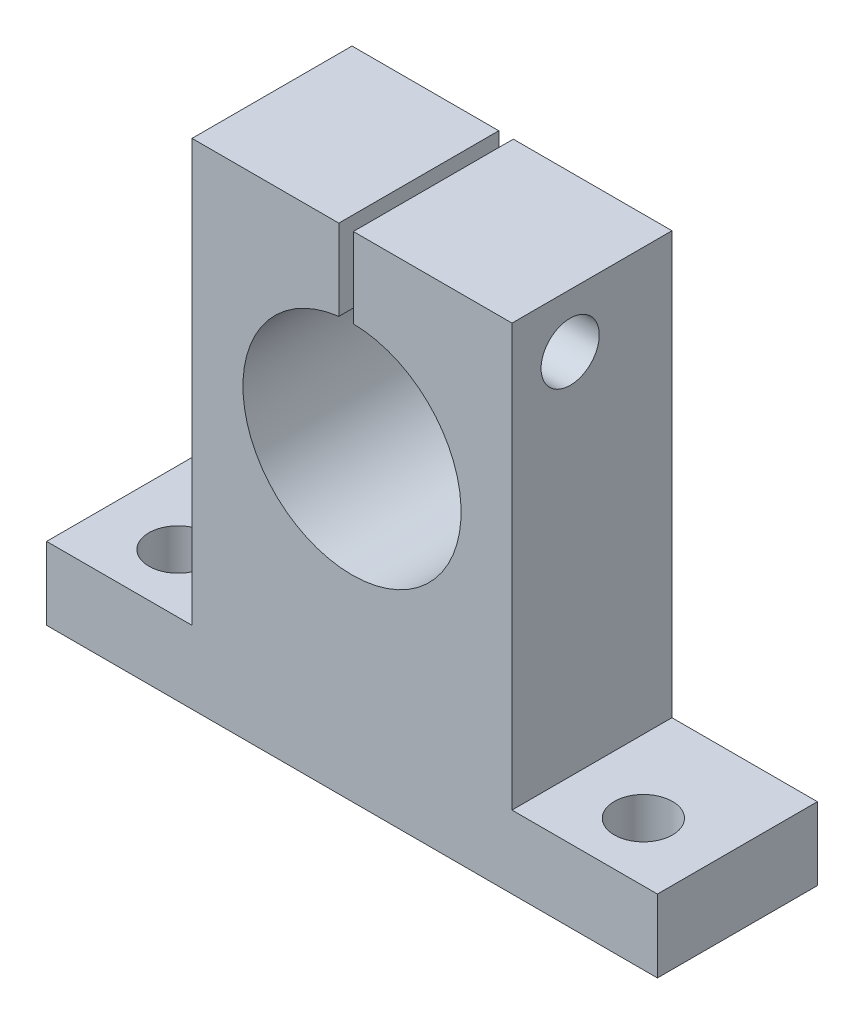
ISO-10303-21;
HEADER;
FILE_DESCRIPTION(('STEP AP214'),'2;1');
FILE_NAME('part.step','',(''),(''),'','','');
FILE_SCHEMA(('AUTOMOTIVE_DESIGN { 1 0 10303 214 1 1 1 1 }'));
ENDSEC;
DATA;
#1=APPLICATION_CONTEXT('core data for automotive mechanical design processes');
#2=APPLICATION_PROTOCOL_DEFINITION('international standard','automotive_design',2000,#1);
#3=PRODUCT_CONTEXT('',#1,'mechanical');
#4=PRODUCT('Part','Part','',(#3));
#5=PRODUCT_RELATED_PRODUCT_CATEGORY('part','',(#4));
#6=PRODUCT_DEFINITION_FORMATION('','',#4);
#7=PRODUCT_DEFINITION_CONTEXT('part definition',#1,'design');
#8=PRODUCT_DEFINITION('design','',#6,#7);
#9=PRODUCT_DEFINITION_SHAPE('','',#8);
#10=(LENGTH_UNIT() NAMED_UNIT(*) SI_UNIT(.MILLI.,.METRE.));
#11=(NAMED_UNIT(*) PLANE_ANGLE_UNIT() SI_UNIT($,.RADIAN.));
#12=(NAMED_UNIT(*) SI_UNIT($,.STERADIAN.) SOLID_ANGLE_UNIT());
#13=UNCERTAINTY_MEASURE_WITH_UNIT(LENGTH_MEASURE(1.E-05),#10,'distance_accuracy_value','');
#14=(GEOMETRIC_REPRESENTATION_CONTEXT(3) GLOBAL_UNCERTAINTY_ASSIGNED_CONTEXT((#13)) GLOBAL_UNIT_ASSIGNED_CONTEXT((#10,
#11,#12)) REPRESENTATION_CONTEXT('',''));
#15=CARTESIAN_POINT('',(0.,0.,0.));
#16=DIRECTION('',(0.,0.,1.));
#17=DIRECTION('',(1.,0.,0.));
#18=AXIS2_PLACEMENT_3D('',#15,#16,#17);
#19=CARTESIAN_POINT('',(0.681248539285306,58.3546814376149,22.));
#20=DIRECTION('',(0.,-1.,0.));
#21=DIRECTION('',(0.,0.,-1.));
#22=AXIS2_PLACEMENT_3D('',#19,#20,#21);
#23=PLANE('',#22);
#24=DIRECTION('',(0.,0.,1.));
#25=VECTOR('',#24,1.);
#26=CARTESIAN_POINT('',(20.8653991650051,58.3546814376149,0.));
#27=LINE('',#26,#25);
#28=CARTESIAN_POINT('',(20.8653991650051,58.3546814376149,0.));
#29=VERTEX_POINT('',#28);
#30=CARTESIAN_POINT('',(20.8653991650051,58.3546814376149,22.));
#31=VERTEX_POINT('',#30);
#32=EDGE_CURVE('E166',#29,#31,#27,.T.);
#33=ORIENTED_EDGE('',*,*,#32,.F.);
#34=DIRECTION('',(-1.,0.,0.));
#35=VECTOR('',#34,1.);
#36=CARTESIAN_POINT('',(0.681248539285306,58.3546814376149,0.));
#37=LINE('',#36,#35);
#38=CARTESIAN_POINT('',(0.681248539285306,58.3546814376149,0.));
#39=VERTEX_POINT('',#38);
#40=EDGE_CURVE('E196',#29,#39,#37,.T.);
#41=ORIENTED_EDGE('',*,*,#40,.T.);
#42=DIRECTION('',(0.,0.,-1.));
#43=VECTOR('',#42,1.);
#44=CARTESIAN_POINT('',(0.681248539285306,58.3546814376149,22.));
#45=LINE('',#44,#43);
#46=CARTESIAN_POINT('',(0.681248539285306,58.3546814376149,22.));
#47=VERTEX_POINT('',#46);
#48=EDGE_CURVE('E218',#47,#39,#45,.T.);
#49=ORIENTED_EDGE('',*,*,#48,.F.);
#50=DIRECTION('',(-1.,0.,0.));
#51=VECTOR('',#50,1.);
#52=CARTESIAN_POINT('',(0.681248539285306,58.3546814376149,22.));
#53=LINE('',#52,#51);
#54=EDGE_CURVE('E177',#31,#47,#53,.T.);
#55=ORIENTED_EDGE('',*,*,#54,.F.);
#56=EDGE_LOOP('',(#33,#41,#49,#55));
#57=FACE_BOUND('',#56,.T.);
#58=ADVANCED_FACE('F32',(#57),#23,.F.);
#59=CARTESIAN_POINT('',(0.,0.,22.));
#60=DIRECTION('',(0.,0.,-1.));
#61=DIRECTION('',(-1.,0.,0.));
#62=AXIS2_PLACEMENT_3D('',#59,#60,#61);
#63=PLANE('',#62);
#64=DIRECTION('',(0.,1.,0.));
#65=VECTOR('',#64,1.);
#66=CARTESIAN_POINT('',(20.8653991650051,58.1616180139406,22.));
#67=LINE('',#66,#65);
#68=CARTESIAN_POINT('',(20.8653991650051,47.2443654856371,22.));
#69=VERTEX_POINT('',#68);
#70=EDGE_CURVE('E299',#69,#31,#67,.T.);
#71=ORIENTED_EDGE('',*,*,#70,.T.);
#72=ORIENTED_EDGE('',*,*,#54,.T.);
#73=DIRECTION('',(0.,-1.,0.));
#74=VECTOR('',#73,1.);
#75=CARTESIAN_POINT('',(0.681248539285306,0.354681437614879,22.));
#76=LINE('',#75,#74);
#77=CARTESIAN_POINT('',(0.681248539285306,0.354681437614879,22.));
#78=VERTEX_POINT('',#77);
#79=EDGE_CURVE('E181',#47,#78,#76,.T.);
#80=ORIENTED_EDGE('',*,*,#79,.T.);
#81=DIRECTION('',(-1.,0.,0.));
#82=VECTOR('',#81,1.);
#83=CARTESIAN_POINT('',(-19.3187514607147,0.354681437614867,22.));
#84=LINE('',#83,#82);
#85=CARTESIAN_POINT('',(-19.3187514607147,0.354681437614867,22.));
#86=VERTEX_POINT('',#85);
#87=EDGE_CURVE('E183',#78,#86,#84,.T.);
#88=ORIENTED_EDGE('',*,*,#87,.T.);
#89=DIRECTION('',(0.,-1.,0.));
#90=VECTOR('',#89,1.);
#91=CARTESIAN_POINT('',(-19.3187514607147,-9.64531856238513,22.));
#92=LINE('',#91,#90);
#93=CARTESIAN_POINT('',(-19.3187514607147,-9.64531856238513,22.));
#94=VERTEX_POINT('',#93);
#95=EDGE_CURVE('E185',#86,#94,#92,.T.);
#96=ORIENTED_EDGE('',*,*,#95,.T.);
#97=DIRECTION('',(1.,0.,0.));
#98=VECTOR('',#97,1.);
#99=CARTESIAN_POINT('',(-19.3187514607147,-9.64531856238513,22.));
#100=LINE('',#99,#98);
#101=CARTESIAN_POINT('',(64.6812485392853,-9.64531856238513,22.));
#102=VERTEX_POINT('',#101);
#103=EDGE_CURVE('E187',#94,#102,#100,.T.);
#104=ORIENTED_EDGE('',*,*,#103,.T.);
#105=DIRECTION('',(0.,1.,0.));
#106=VECTOR('',#105,1.);
#107=CARTESIAN_POINT('',(64.6812485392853,-9.64531856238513,22.));
#108=LINE('',#107,#106);
#109=CARTESIAN_POINT('',(64.6812485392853,0.354681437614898,22.));
#110=VERTEX_POINT('',#109);
#111=EDGE_CURVE('E169',#102,#110,#108,.T.);
#112=ORIENTED_EDGE('',*,*,#111,.T.);
#113=DIRECTION('',(-1.,0.,0.));
#114=VECTOR('',#113,1.);
#115=CARTESIAN_POINT('',(44.6812485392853,0.354681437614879,22.));
#116=LINE('',#115,#114);
#117=CARTESIAN_POINT('',(44.6812485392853,0.354681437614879,22.));
#118=VERTEX_POINT('',#117);
#119=EDGE_CURVE('E172',#110,#118,#116,.T.);
#120=ORIENTED_EDGE('',*,*,#119,.T.);
#121=DIRECTION('',(0.,1.,0.));
#122=VECTOR('',#121,1.);
#123=CARTESIAN_POINT('',(44.6812485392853,0.354681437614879,22.));
#124=LINE('',#123,#122);
#125=CARTESIAN_POINT('',(44.6812485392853,58.3546814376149,22.));
#126=VERTEX_POINT('',#125);
#127=EDGE_CURVE('E175',#118,#126,#124,.T.);
#128=ORIENTED_EDGE('',*,*,#127,.T.);
#129=CARTESIAN_POINT('',(22.8653991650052,58.3546814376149,22.));
#130=VERTEX_POINT('',#129);
#131=EDGE_CURVE('E178',#126,#130,#53,.T.);
#132=ORIENTED_EDGE('',*,*,#131,.T.);
#133=DIRECTION('',(0.,1.,0.));
#134=VECTOR('',#133,1.);
#135=CARTESIAN_POINT('',(22.8653991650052,47.3535510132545,22.));
#136=LINE('',#135,#134);
#137=CARTESIAN_POINT('',(22.8653991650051,47.3535510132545,22.));
#138=VERTEX_POINT('',#137);
#139=EDGE_CURVE('E301',#138,#130,#136,.T.);
#140=ORIENTED_EDGE('',*,*,#139,.F.);
#141=CARTESIAN_POINT('',(22.6812485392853,32.3546814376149,22.));
#142=DIRECTION('',(0.,0.,1.));
#143=DIRECTION('',(1.,0.,0.));
#144=AXIS2_PLACEMENT_3D('',#141,#142,#143);
#145=CIRCLE('',#144,15.);
#146=EDGE_CURVE('E159',#69,#138,#145,.T.);
#147=ORIENTED_EDGE('',*,*,#146,.F.);
#148=EDGE_LOOP('',(#71,#72,#80,#88,#96,#104,#112,#120,#128,#132,#140,#147));
#149=FACE_BOUND('',#148,.T.);
#150=ADVANCED_FACE('F258',(#149),#63,.F.);
#151=CARTESIAN_POINT('',(0.,0.,0.));
#152=DIRECTION('',(0.,0.,-1.));
#153=DIRECTION('',(-1.,0.,0.));
#154=AXIS2_PLACEMENT_3D('',#151,#152,#153);
#155=PLANE('',#154);
#156=ORIENTED_EDGE('',*,*,#40,.F.);
#157=DIRECTION('',(0.,1.,0.));
#158=VECTOR('',#157,1.);
#159=CARTESIAN_POINT('',(20.8653991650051,47.2443654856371,0.));
#160=LINE('',#159,#158);
#161=CARTESIAN_POINT('',(20.8653991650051,47.2443654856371,0.));
#162=VERTEX_POINT('',#161);
#163=EDGE_CURVE('E293',#162,#29,#160,.T.);
#164=ORIENTED_EDGE('',*,*,#163,.F.);
#165=CARTESIAN_POINT('',(22.6812485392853,32.3546814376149,0.));
#166=DIRECTION('',(0.,0.,1.));
#167=DIRECTION('',(1.,0.,0.));
#168=AXIS2_PLACEMENT_3D('',#165,#166,#167);
#169=CIRCLE('',#168,15.);
#170=CARTESIAN_POINT('',(22.8653991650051,47.3535510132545,0.));
#171=VERTEX_POINT('',#170);
#172=EDGE_CURVE('E152',#162,#171,#169,.T.);
#173=ORIENTED_EDGE('',*,*,#172,.T.);
#174=DIRECTION('',(0.,-1.,0.));
#175=VECTOR('',#174,1.);
#176=CARTESIAN_POINT('',(22.8653991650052,58.3546814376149,0.));
#177=LINE('',#176,#175);
#178=CARTESIAN_POINT('',(22.8653991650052,58.3546814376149,0.));
#179=VERTEX_POINT('',#178);
#180=EDGE_CURVE('E291',#179,#171,#177,.T.);
#181=ORIENTED_EDGE('',*,*,#180,.F.);
#182=CARTESIAN_POINT('',(44.6812485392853,58.3546814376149,0.));
#183=VERTEX_POINT('',#182);
#184=EDGE_CURVE('E197',#183,#179,#37,.T.);
#185=ORIENTED_EDGE('',*,*,#184,.F.);
#186=DIRECTION('',(0.,1.,0.));
#187=VECTOR('',#186,1.);
#188=CARTESIAN_POINT('',(44.6812485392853,0.354681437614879,0.));
#189=LINE('',#188,#187);
#190=CARTESIAN_POINT('',(44.6812485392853,0.354681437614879,0.));
#191=VERTEX_POINT('',#190);
#192=EDGE_CURVE('E194',#191,#183,#189,.T.);
#193=ORIENTED_EDGE('',*,*,#192,.F.);
#194=DIRECTION('',(-1.,0.,0.));
#195=VECTOR('',#194,1.);
#196=CARTESIAN_POINT('',(44.6812485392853,0.354681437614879,0.));
#197=LINE('',#196,#195);
#198=CARTESIAN_POINT('',(64.6812485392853,0.354681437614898,0.));
#199=VERTEX_POINT('',#198);
#200=EDGE_CURVE('E192',#199,#191,#197,.T.);
#201=ORIENTED_EDGE('',*,*,#200,.F.);
#202=DIRECTION('',(0.,1.,0.));
#203=VECTOR('',#202,1.);
#204=CARTESIAN_POINT('',(64.6812485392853,-9.64531856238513,0.));
#205=LINE('',#204,#203);
#206=CARTESIAN_POINT('',(64.6812485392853,-9.64531856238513,0.));
#207=VERTEX_POINT('',#206);
#208=EDGE_CURVE('E168',#207,#199,#205,.T.);
#209=ORIENTED_EDGE('',*,*,#208,.F.);
#210=DIRECTION('',(1.,0.,0.));
#211=VECTOR('',#210,1.);
#212=CARTESIAN_POINT('',(-19.3187514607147,-9.64531856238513,0.));
#213=LINE('',#212,#211);
#214=CARTESIAN_POINT('',(-19.3187514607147,-9.64531856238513,0.));
#215=VERTEX_POINT('',#214);
#216=EDGE_CURVE('E173',#215,#207,#213,.T.);
#217=ORIENTED_EDGE('',*,*,#216,.F.);
#218=DIRECTION('',(0.,-1.,0.));
#219=VECTOR('',#218,1.);
#220=CARTESIAN_POINT('',(-19.3187514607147,-9.64531856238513,0.));
#221=LINE('',#220,#219);
#222=CARTESIAN_POINT('',(-19.3187514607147,0.354681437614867,0.));
#223=VERTEX_POINT('',#222);
#224=EDGE_CURVE('E204',#223,#215,#221,.T.);
#225=ORIENTED_EDGE('',*,*,#224,.F.);
#226=DIRECTION('',(-1.,0.,0.));
#227=VECTOR('',#226,1.);
#228=CARTESIAN_POINT('',(-19.3187514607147,0.354681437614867,0.));
#229=LINE('',#228,#227);
#230=CARTESIAN_POINT('',(0.681248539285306,0.354681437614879,0.));
#231=VERTEX_POINT('',#230);
#232=EDGE_CURVE('E202',#231,#223,#229,.T.);
#233=ORIENTED_EDGE('',*,*,#232,.F.);
#234=DIRECTION('',(0.,-1.,0.));
#235=VECTOR('',#234,1.);
#236=CARTESIAN_POINT('',(0.681248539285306,0.354681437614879,0.));
#237=LINE('',#236,#235);
#238=EDGE_CURVE('E200',#39,#231,#237,.T.);
#239=ORIENTED_EDGE('',*,*,#238,.F.);
#240=EDGE_LOOP('',(#156,#164,#173,#181,#185,#193,#201,#209,#217,#225,#233,#239));
#241=FACE_BOUND('',#240,.T.);
#242=ADVANCED_FACE('F265',(#241),#155,.T.);
#243=CARTESIAN_POINT('',(64.6812485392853,-9.64531856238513,22.));
#244=DIRECTION('',(-1.,0.,0.));
#245=DIRECTION('',(0.,0.,1.));
#246=AXIS2_PLACEMENT_3D('',#243,#244,#245);
#247=PLANE('',#246);
#248=ORIENTED_EDGE('',*,*,#208,.T.);
#249=DIRECTION('',(0.,0.,-1.));
#250=VECTOR('',#249,1.);
#251=CARTESIAN_POINT('',(64.6812485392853,0.354681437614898,22.));
#252=LINE('',#251,#250);
#253=EDGE_CURVE('E140',#110,#199,#252,.T.);
#254=ORIENTED_EDGE('',*,*,#253,.F.);
#255=ORIENTED_EDGE('',*,*,#111,.F.);
#256=DIRECTION('',(0.,0.,-1.));
#257=VECTOR('',#256,1.);
#258=CARTESIAN_POINT('',(64.6812485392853,-9.64531856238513,22.));
#259=LINE('',#258,#257);
#260=EDGE_CURVE('E189',#102,#207,#259,.T.);
#261=ORIENTED_EDGE('',*,*,#260,.T.);
#262=EDGE_LOOP('',(#248,#254,#255,#261));
#263=FACE_BOUND('',#262,.T.);
#264=ADVANCED_FACE('F34',(#263),#247,.F.);
#265=CARTESIAN_POINT('',(44.6812485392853,0.354681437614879,22.));
#266=DIRECTION('',(0.,-1.,0.));
#267=DIRECTION('',(1.,0.,0.));
#268=AXIS2_PLACEMENT_3D('',#265,#266,#267);
#269=PLANE('',#268);
#270=CARTESIAN_POINT('',(54.6812485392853,0.354681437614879,13.9325883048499));
#271=DIRECTION('',(0.,1.,0.));
#272=DIRECTION('',(0.,0.,1.));
#273=AXIS2_PLACEMENT_3D('',#270,#271,#272);
#274=CIRCLE('',#273,4.);
#275=CARTESIAN_POINT('',(54.6812485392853,0.354681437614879,17.9325883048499));
#276=VERTEX_POINT('',#275);
#277=EDGE_CURVE('E231',#276,#276,#274,.T.);
#278=ORIENTED_EDGE('',*,*,#277,.F.);
#279=EDGE_LOOP('',(#278));
#280=FACE_BOUND('',#279,.T.);
#281=ORIENTED_EDGE('',*,*,#200,.T.);
#282=DIRECTION('',(0.,0.,-1.));
#283=VECTOR('',#282,1.);
#284=CARTESIAN_POINT('',(44.6812485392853,0.354681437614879,22.));
#285=LINE('',#284,#283);
#286=EDGE_CURVE('E224',#118,#191,#285,.T.);
#287=ORIENTED_EDGE('',*,*,#286,.F.);
#288=ORIENTED_EDGE('',*,*,#119,.F.);
#289=ORIENTED_EDGE('',*,*,#253,.T.);
#290=EDGE_LOOP('',(#281,#287,#288,#289));
#291=FACE_BOUND('',#290,.T.);
#292=ADVANCED_FACE('F281',(#280,#291),#269,.F.);
#293=CARTESIAN_POINT('',(44.6812485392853,0.354681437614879,22.));
#294=DIRECTION('',(-1.,0.,0.));
#295=DIRECTION('',(0.,0.,1.));
#296=AXIS2_PLACEMENT_3D('',#293,#294,#295);
#297=PLANE('',#296);
#298=CARTESIAN_POINT('',(44.6812485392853,50.9384829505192,14.));
#299=DIRECTION('',(-1.,0.,0.));
#300=DIRECTION('',(0.,0.,1.));
#301=AXIS2_PLACEMENT_3D('',#298,#299,#300);
#302=CIRCLE('',#301,3.99999999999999);
#303=CARTESIAN_POINT('',(44.6812485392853,50.9384829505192,18.));
#304=VERTEX_POINT('',#303);
#305=EDGE_CURVE('E356',#304,#304,#302,.T.);
#306=ORIENTED_EDGE('',*,*,#305,.T.);
#307=EDGE_LOOP('',(#306));
#308=FACE_BOUND('',#307,.T.);
#309=ORIENTED_EDGE('',*,*,#192,.T.);
#310=DIRECTION('',(0.,0.,-1.));
#311=VECTOR('',#310,1.);
#312=CARTESIAN_POINT('',(44.6812485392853,58.3546814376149,22.));
#313=LINE('',#312,#311);
#314=EDGE_CURVE('E221',#126,#183,#313,.T.);
#315=ORIENTED_EDGE('',*,*,#314,.F.);
#316=ORIENTED_EDGE('',*,*,#127,.F.);
#317=ORIENTED_EDGE('',*,*,#286,.T.);
#318=EDGE_LOOP('',(#309,#315,#316,#317));
#319=FACE_BOUND('',#318,.T.);
#320=ADVANCED_FACE('F273',(#308,#319),#297,.F.);
#321=ORIENTED_EDGE('',*,*,#184,.T.);
#322=DIRECTION('',(0.,0.,1.));
#323=VECTOR('',#322,1.);
#324=CARTESIAN_POINT('',(22.8653991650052,58.3546814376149,0.));
#325=LINE('',#324,#323);
#326=EDGE_CURVE('E163',#179,#130,#325,.T.);
#327=ORIENTED_EDGE('',*,*,#326,.T.);
#328=ORIENTED_EDGE('',*,*,#131,.F.);
#329=ORIENTED_EDGE('',*,*,#314,.T.);
#330=EDGE_LOOP('',(#321,#327,#328,#329));
#331=FACE_BOUND('',#330,.T.);
#332=ADVANCED_FACE('F261',(#331),#23,.F.);
#333=CARTESIAN_POINT('',(0.681248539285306,0.354681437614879,22.));
#334=DIRECTION('',(1.,0.,0.));
#335=DIRECTION('',(0.,0.,-1.));
#336=AXIS2_PLACEMENT_3D('',#333,#334,#335);
#337=PLANE('',#336);
#338=CARTESIAN_POINT('',(0.681248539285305,50.9384829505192,14.));
#339=DIRECTION('',(-1.,0.,0.));
#340=DIRECTION('',(0.,0.,1.));
#341=AXIS2_PLACEMENT_3D('',#338,#339,#340);
#342=CIRCLE('',#341,3.99999999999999);
#343=CARTESIAN_POINT('',(0.681248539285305,50.9384829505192,18.));
#344=VERTEX_POINT('',#343);
#345=EDGE_CURVE('E147',#344,#344,#342,.T.);
#346=ORIENTED_EDGE('',*,*,#345,.F.);
#347=EDGE_LOOP('',(#346));
#348=FACE_BOUND('',#347,.T.);
#349=ORIENTED_EDGE('',*,*,#238,.T.);
#350=DIRECTION('',(0.,0.,-1.));
#351=VECTOR('',#350,1.);
#352=CARTESIAN_POINT('',(0.681248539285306,0.354681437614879,22.));
#353=LINE('',#352,#351);
#354=EDGE_CURVE('E215',#78,#231,#353,.T.);
#355=ORIENTED_EDGE('',*,*,#354,.F.);
#356=ORIENTED_EDGE('',*,*,#79,.F.);
#357=ORIENTED_EDGE('',*,*,#48,.T.);
#358=EDGE_LOOP('',(#349,#355,#356,#357));
#359=FACE_BOUND('',#358,.T.);
#360=ADVANCED_FACE('F272',(#348,#359),#337,.F.);
#361=CARTESIAN_POINT('',(-19.3187514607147,0.354681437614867,22.));
#362=DIRECTION('',(0.,-1.,0.));
#363=DIRECTION('',(1.,0.,0.));
#364=AXIS2_PLACEMENT_3D('',#361,#362,#363);
#365=PLANE('',#364);
#366=CARTESIAN_POINT('',(-9.31875146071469,0.354681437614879,13.9325883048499));
#367=DIRECTION('',(0.,1.,0.));
#368=DIRECTION('',(0.,0.,1.));
#369=AXIS2_PLACEMENT_3D('',#366,#367,#368);
#370=CIRCLE('',#369,4.);
#371=CARTESIAN_POINT('',(-9.31875146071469,0.354681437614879,17.9325883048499));
#372=VERTEX_POINT('',#371);
#373=EDGE_CURVE('E232',#372,#372,#370,.T.);
#374=ORIENTED_EDGE('',*,*,#373,.F.);
#375=EDGE_LOOP('',(#374));
#376=FACE_BOUND('',#375,.T.);
#377=ORIENTED_EDGE('',*,*,#232,.T.);
#378=DIRECTION('',(0.,0.,-1.));
#379=VECTOR('',#378,1.);
#380=CARTESIAN_POINT('',(-19.3187514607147,0.354681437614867,22.));
#381=LINE('',#380,#379);
#382=EDGE_CURVE('E212',#86,#223,#381,.T.);
#383=ORIENTED_EDGE('',*,*,#382,.F.);
#384=ORIENTED_EDGE('',*,*,#87,.F.);
#385=ORIENTED_EDGE('',*,*,#354,.T.);
#386=EDGE_LOOP('',(#377,#383,#384,#385));
#387=FACE_BOUND('',#386,.T.);
#388=ADVANCED_FACE('F279',(#376,#387),#365,.F.);
#389=CARTESIAN_POINT('',(-19.3187514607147,-9.64531856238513,22.));
#390=DIRECTION('',(1.,0.,0.));
#391=DIRECTION('',(0.,1.,0.));
#392=AXIS2_PLACEMENT_3D('',#389,#390,#391);
#393=PLANE('',#392);
#394=ORIENTED_EDGE('',*,*,#224,.T.);
#395=DIRECTION('',(0.,0.,-1.));
#396=VECTOR('',#395,1.);
#397=CARTESIAN_POINT('',(-19.3187514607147,-9.64531856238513,22.));
#398=LINE('',#397,#396);
#399=EDGE_CURVE('E209',#94,#215,#398,.T.);
#400=ORIENTED_EDGE('',*,*,#399,.F.);
#401=ORIENTED_EDGE('',*,*,#95,.F.);
#402=ORIENTED_EDGE('',*,*,#382,.T.);
#403=EDGE_LOOP('',(#394,#400,#401,#402));
#404=FACE_BOUND('',#403,.T.);
#405=ADVANCED_FACE('F323',(#404),#393,.F.);
#406=CARTESIAN_POINT('',(-19.3187514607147,-9.64531856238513,22.));
#407=DIRECTION('',(0.,1.,0.));
#408=DIRECTION('',(0.,0.,1.));
#409=AXIS2_PLACEMENT_3D('',#406,#407,#408);
#410=PLANE('',#409);
#411=CARTESIAN_POINT('',(-9.31875146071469,-9.64531856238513,13.9325883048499));
#412=DIRECTION('',(0.,1.,0.));
#413=DIRECTION('',(0.,0.,1.));
#414=AXIS2_PLACEMENT_3D('',#411,#412,#413);
#415=CIRCLE('',#414,4.);
#416=CARTESIAN_POINT('',(-9.31875146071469,-9.64531856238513,17.9325883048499));
#417=VERTEX_POINT('',#416);
#418=EDGE_CURVE('E229',#417,#417,#415,.T.);
#419=ORIENTED_EDGE('',*,*,#418,.T.);
#420=EDGE_LOOP('',(#419));
#421=FACE_BOUND('',#420,.T.);
#422=CARTESIAN_POINT('',(54.6812485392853,-9.64531856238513,13.9325883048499));
#423=DIRECTION('',(0.,1.,0.));
#424=DIRECTION('',(0.,0.,1.));
#425=AXIS2_PLACEMENT_3D('',#422,#423,#424);
#426=CIRCLE('',#425,4.);
#427=CARTESIAN_POINT('',(54.6812485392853,-9.64531856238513,17.9325883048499));
#428=VERTEX_POINT('',#427);
#429=EDGE_CURVE('E302',#428,#428,#426,.T.);
#430=ORIENTED_EDGE('',*,*,#429,.T.);
#431=EDGE_LOOP('',(#430));
#432=FACE_BOUND('',#431,.T.);
#433=ORIENTED_EDGE('',*,*,#216,.T.);
#434=ORIENTED_EDGE('',*,*,#260,.F.);
#435=ORIENTED_EDGE('',*,*,#103,.F.);
#436=ORIENTED_EDGE('',*,*,#399,.T.);
#437=EDGE_LOOP('',(#433,#434,#435,#436));
#438=FACE_BOUND('',#437,.T.);
#439=ADVANCED_FACE('F319',(#421,#432,#438),#410,.F.);
#440=CARTESIAN_POINT('',(20.8653991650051,58.1616180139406,0.));
#441=DIRECTION('',(1.,0.,0.));
#442=DIRECTION('',(0.,0.,-1.));
#443=AXIS2_PLACEMENT_3D('',#440,#441,#442);
#444=PLANE('',#443);
#445=CARTESIAN_POINT('',(20.8653991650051,50.9384829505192,14.));
#446=DIRECTION('',(1.,0.,0.));
#447=DIRECTION('',(0.,0.,-1.));
#448=AXIS2_PLACEMENT_3D('',#445,#446,#447);
#449=CIRCLE('',#448,3.99999999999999);
#450=CARTESIAN_POINT('',(20.8653991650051,47.2443654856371,12.4658891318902));
#451=VERTEX_POINT('',#450);
#452=CARTESIAN_POINT('',(20.8653991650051,47.2443654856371,15.5341108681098));
#453=VERTEX_POINT('',#452);
#454=EDGE_CURVE('E52',#451,#453,#449,.T.);
#455=ORIENTED_EDGE('',*,*,#454,.F.);
#456=DIRECTION('',(0.,0.,1.));
#457=VECTOR('',#456,1.);
#458=CARTESIAN_POINT('',(20.8653991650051,47.2443654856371,0.));
#459=LINE('',#458,#457);
#460=EDGE_CURVE('E143',#162,#451,#459,.T.);
#461=ORIENTED_EDGE('',*,*,#460,.F.);
#462=ORIENTED_EDGE('',*,*,#163,.T.);
#463=ORIENTED_EDGE('',*,*,#32,.T.);
#464=ORIENTED_EDGE('',*,*,#70,.F.);
#465=EDGE_CURVE('E146',#453,#69,#459,.T.);
#466=ORIENTED_EDGE('',*,*,#465,.F.);
#467=EDGE_LOOP('',(#455,#461,#462,#463,#464,#466));
#468=FACE_BOUND('',#467,.T.);
#469=ADVANCED_FACE('F142',(#468),#444,.T.);
#470=CARTESIAN_POINT('',(22.8653991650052,47.3535510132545,0.));
#471=DIRECTION('',(1.,0.,0.));
#472=DIRECTION('',(0.,0.,-1.));
#473=AXIS2_PLACEMENT_3D('',#470,#471,#472);
#474=PLANE('',#473);
#475=DIRECTION('',(0.,0.,1.));
#476=VECTOR('',#475,1.);
#477=CARTESIAN_POINT('',(22.8653991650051,47.3535510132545,0.));
#478=LINE('',#477,#476);
#479=CARTESIAN_POINT('',(22.8653991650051,47.3535510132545,12.2256654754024));
#480=VERTEX_POINT('',#479);
#481=EDGE_CURVE('E156',#171,#480,#478,.T.);
#482=ORIENTED_EDGE('',*,*,#481,.T.);
#483=CARTESIAN_POINT('',(22.8653991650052,50.9384829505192,14.));
#484=DIRECTION('',(1.,0.,0.));
#485=DIRECTION('',(0.,0.,-1.));
#486=AXIS2_PLACEMENT_3D('',#483,#484,#485);
#487=CIRCLE('',#486,3.99999999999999);
#488=CARTESIAN_POINT('',(22.8653991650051,47.3535510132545,15.7743345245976));
#489=VERTEX_POINT('',#488);
#490=EDGE_CURVE('E59',#480,#489,#487,.T.);
#491=ORIENTED_EDGE('',*,*,#490,.T.);
#492=EDGE_CURVE('E154',#489,#138,#478,.T.);
#493=ORIENTED_EDGE('',*,*,#492,.T.);
#494=ORIENTED_EDGE('',*,*,#139,.T.);
#495=ORIENTED_EDGE('',*,*,#326,.F.);
#496=ORIENTED_EDGE('',*,*,#180,.T.);
#497=EDGE_LOOP('',(#482,#491,#493,#494,#495,#496));
#498=FACE_BOUND('',#497,.T.);
#499=ADVANCED_FACE('F254',(#498),#474,.F.);
#500=CARTESIAN_POINT('',(22.6812485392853,32.3546814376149,0.));
#501=DIRECTION('',(0.,0.,1.));
#502=DIRECTION('',(1.,0.,0.));
#503=AXIS2_PLACEMENT_3D('',#500,#501,#502);
#504=CYLINDRICAL_SURFACE('',#503,15.);
#505=ORIENTED_EDGE('',*,*,#492,.F.);
#506=CARTESIAN_POINT('',(22.8653991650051,47.3535510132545,15.7743345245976));
#507=CARTESIAN_POINT('',(22.9485249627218,47.3525308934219,15.7722670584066));
#508=CARTESIAN_POINT('',(23.0315996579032,47.35081906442,15.7688114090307));
#509=CARTESIAN_POINT('',(23.1975548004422,47.346022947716,15.7590521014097));
#510=CARTESIAN_POINT('',(23.2804352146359,47.3429384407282,15.7527479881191));
#511=CARTESIAN_POINT('',(23.5293537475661,47.3316091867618,15.7293870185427));
#512=CARTESIAN_POINT('',(23.6949168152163,47.3212980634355,15.7078987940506));
#513=CARTESIAN_POINT('',(24.0295819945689,47.2949367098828,15.6509380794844));
#514=CARTESIAN_POINT('',(24.1985849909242,47.2786863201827,15.6149727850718));
#515=CARTESIAN_POINT('',(24.5315369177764,47.2410623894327,15.5268984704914));
#516=CARTESIAN_POINT('',(24.6954963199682,47.2197004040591,15.4748257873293));
#517=CARTESIAN_POINT('',(24.9277628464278,47.1856821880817,15.3846884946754));
#518=CARTESIAN_POINT('',(24.9993965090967,47.1746445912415,15.3545098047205));
#519=CARTESIAN_POINT('',(25.1404748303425,47.1518872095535,15.2895297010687));
#520=CARTESIAN_POINT('',(25.2099188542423,47.1401672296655,15.2547269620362));
#521=CARTESIAN_POINT('',(25.3453198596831,47.1163686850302,15.1802364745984));
#522=CARTESIAN_POINT('',(25.4113012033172,47.1042939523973,15.140592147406));
#523=CARTESIAN_POINT('',(25.5393722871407,47.080012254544,15.0555378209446));
#524=CARTESIAN_POINT('',(25.6014654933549,47.0678054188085,15.0101330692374));
#525=CARTESIAN_POINT('',(25.7193377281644,47.0439143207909,14.9136529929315));
#526=CARTESIAN_POINT('',(25.7752108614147,47.0322245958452,14.8626954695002));
#527=CARTESIAN_POINT('',(25.8799871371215,47.0097466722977,14.7537386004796));
#528=CARTESIAN_POINT('',(25.9288903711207,46.9989584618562,14.695739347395));
#529=CARTESIAN_POINT('',(26.0103762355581,46.9806306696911,14.5815734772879));
#530=CARTESIAN_POINT('',(26.0443047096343,46.9728465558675,14.5264194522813));
#531=CARTESIAN_POINT('',(26.1028778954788,46.9592479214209,14.411140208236));
#532=CARTESIAN_POINT('',(26.1275369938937,46.9534303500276,14.3510228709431));
#533=CARTESIAN_POINT('',(26.162159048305,46.945210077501,14.2375630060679));
#534=CARTESIAN_POINT('',(26.1739040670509,46.9423958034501,14.1847983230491));
#535=CARTESIAN_POINT('',(26.1885266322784,46.9388872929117,14.0779877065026));
#536=CARTESIAN_POINT('',(26.1914099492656,46.9381916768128,14.0239426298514));
#537=CARTESIAN_POINT('',(26.188055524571,46.9389985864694,13.9161428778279));
#538=CARTESIAN_POINT('',(26.1818150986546,46.9405017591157,13.8623882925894));
#539=CARTESIAN_POINT('',(26.1607612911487,46.9455383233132,13.7566857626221));
#540=CARTESIAN_POINT('',(26.145941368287,46.949073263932,13.7047392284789));
#541=CARTESIAN_POINT('',(26.1038370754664,46.9590118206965,13.5901905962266));
#542=CARTESIAN_POINT('',(26.0742734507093,46.9659310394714,13.5284760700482));
#543=CARTESIAN_POINT('',(26.0057718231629,46.9816695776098,13.4107853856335));
#544=CARTESIAN_POINT('',(25.9668169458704,46.9904923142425,13.3548198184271));
#545=CARTESIAN_POINT('',(25.8603305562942,47.0140707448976,13.2217909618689));
#546=CARTESIAN_POINT('',(25.7883372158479,47.0295629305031,13.1484600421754));
#547=CARTESIAN_POINT('',(25.634182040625,47.0613610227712,13.0137285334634));
#548=CARTESIAN_POINT('',(25.5519977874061,47.0776686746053,12.952355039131));
#549=CARTESIAN_POINT('',(25.3910931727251,47.1080758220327,12.8464712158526));
#550=CARTESIAN_POINT('',(25.3131126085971,47.1222083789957,12.8008249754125));
#551=CARTESIAN_POINT('',(25.1533859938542,47.149785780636,12.7163530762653));
#552=CARTESIAN_POINT('',(25.0716370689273,47.163230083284,12.6775327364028));
#553=CARTESIAN_POINT('',(24.9050740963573,47.189159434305,12.605713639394));
#554=CARTESIAN_POINT('',(24.8202483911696,47.2016401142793,12.5727406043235));
#555=CARTESIAN_POINT('',(24.6485410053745,47.2253667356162,12.5121075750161));
#556=CARTESIAN_POINT('',(24.561658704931,47.2366122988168,12.4844492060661));
#557=CARTESIAN_POINT('',(24.3428361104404,47.2629529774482,12.4213376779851));
#558=CARTESIAN_POINT('',(24.2099394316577,47.2771876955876,12.3888312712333));
#559=CARTESIAN_POINT('',(23.9418378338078,47.302225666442,12.3331011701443));
#560=CARTESIAN_POINT('',(23.8066313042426,47.3130264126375,12.3098842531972));
#561=CARTESIAN_POINT('',(23.5373480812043,47.3308271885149,12.2722090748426));
#562=CARTESIAN_POINT('',(23.4032972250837,47.3378942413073,12.2575957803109));
#563=CARTESIAN_POINT('',(23.1346578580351,47.3484314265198,12.2360252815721));
#564=CARTESIAN_POINT('',(23.0000705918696,47.3519074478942,12.2290555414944));
#565=CARTESIAN_POINT('',(22.8653991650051,47.3535510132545,12.2256654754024));
#566=B_SPLINE_CURVE_WITH_KNOTS('',3,(#506,#507,#508,#509,#510,#511,#512,#513,#514,#515,#516,
#517,#518,#519,#520,#521,#522,#523,#524,#525,#526,#527,#528,#529,#530,#531,#532,#533,#534,#535,
#536,#537,#538,#539,#540,#541,#542,#543,#544,#545,#546,#547,#548,#549,#550,#551,#552,#553,#554,
#555,#556,#557,#558,#559,#560,#561,#562,#563,#564,#565),.UNSPECIFIED.,.F.,.F.,(4,2,2,2,2,2,2,2,
2,2,2,2,2,2,2,2,2,2,2,2,2,2,2,2,2,2,2,2,2,4),(0.,0.249441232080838,0.498922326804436,
1.00013637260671,1.52008973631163,2.03887857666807,2.27428009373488,2.50974922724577,
2.74324337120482,2.97652631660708,3.20557763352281,3.43462594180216,3.62957551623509,
3.82422125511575,3.98588901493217,4.14745147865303,4.30906148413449,4.47079486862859,
4.67598787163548,4.88155235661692,5.19158562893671,5.5023134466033,5.77629351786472,
6.05048614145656,6.32585652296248,6.60131098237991,7.01351091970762,7.42601104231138,
7.83083060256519,8.2349852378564),.UNSPECIFIED.);
#567=EDGE_CURVE('E11',#489,#480,#566,.T.);
#568=ORIENTED_EDGE('',*,*,#567,.T.);
#569=ORIENTED_EDGE('',*,*,#481,.F.);
#570=ORIENTED_EDGE('',*,*,#172,.F.);
#571=ORIENTED_EDGE('',*,*,#460,.T.);
#572=CARTESIAN_POINT('',(20.8653991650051,47.2443654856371,12.4658891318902));
#573=CARTESIAN_POINT('',(20.805768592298,47.2370938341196,12.4834065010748));
#574=CARTESIAN_POINT('',(20.7465073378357,47.2295023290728,12.502029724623));
#575=CARTESIAN_POINT('',(20.6288403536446,47.2137240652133,12.5417028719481));
#576=CARTESIAN_POINT('',(20.5704352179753,47.2055369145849,12.5627543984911));
#577=CARTESIAN_POINT('',(20.3951075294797,47.1799169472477,12.6304904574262));
#578=CARTESIAN_POINT('',(20.2798248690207,47.1616407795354,12.6812575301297));
#579=CARTESIAN_POINT('',(20.0556257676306,47.1235366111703,12.7958973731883));
#580=CARTESIAN_POINT('',(19.9467333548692,47.103703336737,12.8598159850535));
#581=CARTESIAN_POINT('',(19.7403081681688,47.063921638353,13.0033493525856));
#582=CARTESIAN_POINT('',(19.6427090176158,47.0439746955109,13.0828641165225));
#583=CARTESIAN_POINT('',(19.5065763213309,47.0149644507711,13.2200046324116));
#584=CARTESIAN_POINT('',(19.4614910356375,47.0051072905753,13.2709300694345));
#585=CARTESIAN_POINT('',(19.3785975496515,46.9866425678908,13.3787485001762));
#586=CARTESIAN_POINT('',(19.3407923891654,46.9780355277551,13.4356439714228));
#587=CARTESIAN_POINT('',(19.2745069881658,46.9627372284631,13.5559718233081));
#588=CARTESIAN_POINT('',(19.2461539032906,46.9560722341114,13.6194793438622));
#589=CARTESIAN_POINT('',(19.2023522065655,46.9456993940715,13.7510157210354));
#590=CARTESIAN_POINT('',(19.1868745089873,46.9419848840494,13.8190340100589));
#591=CARTESIAN_POINT('',(19.1719015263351,46.9383891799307,13.9472807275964));
#592=CARTESIAN_POINT('',(19.1704776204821,46.9380454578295,14.0072719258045));
#593=CARTESIAN_POINT('',(19.1787645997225,46.9400379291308,14.126438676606));
#594=CARTESIAN_POINT('',(19.1884774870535,46.9423746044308,14.1856140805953));
#595=CARTESIAN_POINT('',(19.2164182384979,46.9490339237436,14.2949160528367));
#596=CARTESIAN_POINT('',(19.2336143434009,46.9531150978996,14.3453300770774));
#597=CARTESIAN_POINT('',(19.2748591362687,46.9627943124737,14.4430730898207));
#598=CARTESIAN_POINT('',(19.2989089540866,46.9683926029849,14.4904015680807));
#599=CARTESIAN_POINT('',(19.3682753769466,46.9843118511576,14.6081453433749));
#600=CARTESIAN_POINT('',(19.417819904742,46.9954843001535,14.675951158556));
#601=CARTESIAN_POINT('',(19.52676048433,47.0193447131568,14.8028333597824));
#602=CARTESIAN_POINT('',(19.5861854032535,47.0320370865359,14.8618831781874));
#603=CARTESIAN_POINT('',(19.7530905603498,47.0664817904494,15.0081954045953));
#604=CARTESIAN_POINT('',(19.8665026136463,47.0887104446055,15.0885214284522));
#605=CARTESIAN_POINT('',(20.1040289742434,47.1321198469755,15.2317344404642));
#606=CARTESIAN_POINT('',(20.2281754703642,47.1532971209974,15.2945664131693));
#607=CARTESIAN_POINT('',(20.4385577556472,47.1863171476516,15.3866227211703));
#608=CARTESIAN_POINT('',(20.5229487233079,47.198843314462,15.4199326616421));
#609=CARTESIAN_POINT('',(20.6931288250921,47.2225912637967,15.480938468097));
#610=CARTESIAN_POINT('',(20.7789007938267,47.2338229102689,15.5086781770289));
#611=CARTESIAN_POINT('',(20.8653991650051,47.2443654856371,15.5341108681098));
#612=B_SPLINE_CURVE_WITH_KNOTS('',3,(#572,#573,#574,#575,#576,#577,#578,#579,#580,#581,#582,
#583,#584,#585,#586,#587,#588,#589,#590,#591,#592,#593,#594,#595,#596,#597,#598,#599,#600,#601,
#602,#603,#604,#605,#606,#607,#608,#609,#610,#611),.UNSPECIFIED.,.F.,.F.,(4,2,2,2,2,2,2,2,2,2,2,
2,2,2,2,2,2,2,2,4),(0.,0.187695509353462,0.375515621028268,0.756640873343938,1.13911780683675,
1.51921831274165,1.72488897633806,1.93064533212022,2.13906738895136,2.34701732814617,
2.52595336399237,2.70492157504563,2.86458060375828,3.024265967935,3.27696160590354,
3.53040894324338,3.95028522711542,4.37146739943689,4.64605116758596,4.91838078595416),.UNSPECIFIED.);
#613=EDGE_CURVE('E46',#451,#453,#612,.T.);
#614=ORIENTED_EDGE('',*,*,#613,.T.);
#615=ORIENTED_EDGE('',*,*,#465,.T.);
#616=ORIENTED_EDGE('',*,*,#146,.T.);
#617=EDGE_LOOP('',(#505,#568,#569,#570,#571,#614,#615,#616));
#618=FACE_BOUND('',#617,.T.);
#619=ADVANCED_FACE('F150',(#618),#504,.F.);
#620=CARTESIAN_POINT('',(54.6812485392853,0.354681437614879,13.9325883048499));
#621=DIRECTION('',(0.,1.,0.));
#622=DIRECTION('',(0.,0.,1.));
#623=AXIS2_PLACEMENT_3D('',#620,#621,#622);
#624=CYLINDRICAL_SURFACE('',#623,4.);
#625=ORIENTED_EDGE('',*,*,#277,.T.);
#626=EDGE_LOOP('',(#625));
#627=FACE_BOUND('',#626,.T.);
#628=ORIENTED_EDGE('',*,*,#429,.F.);
#629=EDGE_LOOP('',(#628));
#630=FACE_BOUND('',#629,.T.);
#631=ADVANCED_FACE('F247',(#627,#630),#624,.F.);
#632=CARTESIAN_POINT('',(-9.31875146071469,0.354681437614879,13.9325883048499));
#633=DIRECTION('',(0.,1.,0.));
#634=DIRECTION('',(0.,0.,1.));
#635=AXIS2_PLACEMENT_3D('',#632,#633,#634);
#636=CYLINDRICAL_SURFACE('',#635,4.);
#637=ORIENTED_EDGE('',*,*,#373,.T.);
#638=EDGE_LOOP('',(#637));
#639=FACE_BOUND('',#638,.T.);
#640=ORIENTED_EDGE('',*,*,#418,.F.);
#641=EDGE_LOOP('',(#640));
#642=FACE_BOUND('',#641,.T.);
#643=ADVANCED_FACE('F244',(#639,#642),#636,.F.);
#644=CARTESIAN_POINT('',(0.681248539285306,50.9384829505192,14.));
#645=DIRECTION('',(-1.,0.,0.));
#646=DIRECTION('',(0.,0.,1.));
#647=AXIS2_PLACEMENT_3D('',#644,#645,#646);
#648=CYLINDRICAL_SURFACE('',#647,3.99999999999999);
#649=ORIENTED_EDGE('',*,*,#454,.T.);
#650=ORIENTED_EDGE('',*,*,#613,.F.);
#651=EDGE_LOOP('',(#649,#650));
#652=FACE_BOUND('',#651,.T.);
#653=ORIENTED_EDGE('',*,*,#345,.T.);
#654=EDGE_LOOP('',(#653));
#655=FACE_BOUND('',#654,.T.);
#656=ADVANCED_FACE('F135',(#652,#655),#648,.F.);
#657=ORIENTED_EDGE('',*,*,#567,.F.);
#658=ORIENTED_EDGE('',*,*,#490,.F.);
#659=EDGE_LOOP('',(#657,#658));
#660=FACE_BOUND('',#659,.T.);
#661=ORIENTED_EDGE('',*,*,#305,.F.);
#662=EDGE_LOOP('',(#661));
#663=FACE_BOUND('',#662,.T.);
#664=ADVANCED_FACE('F243',(#660,#663),#648,.F.);
#665=CLOSED_SHELL('',(#58,#150,#242,#264,#292,#320,#332,#360,#388,#405,#439,#469,#499,#619,#631,
#643,#656,#664));
#666=MANIFOLD_SOLID_BREP('B2',#665);
#667=ADVANCED_BREP_SHAPE_REPRESENTATION('',(#18,#666),#14);
#668=SHAPE_DEFINITION_REPRESENTATION(#9,#667);
ENDSEC;
END-ISO-10303-21;
